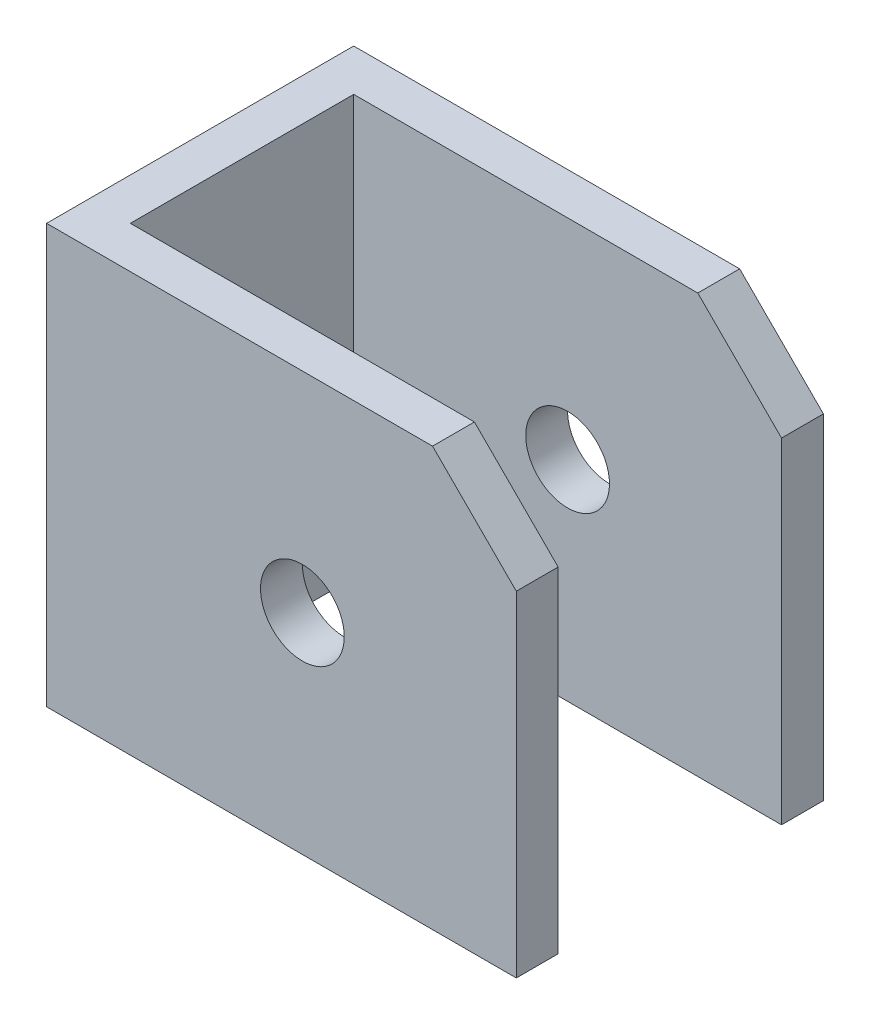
from build123d import *

# Parameters (mm, degrees)
EXTRUDE_THIN1_DEPTH        = 50
F_10_0_10_DIAMETER_HOLE1_D = 10
CHAMFER1_SIZE              = 10


with BuildPart() as part:
    # Sketch1 → Extrude-Thin1 (new body)
    with BuildSketch(Plane(origin=(0, 0, 0), x_dir=(1, 0, 0), z_dir=(0, 1, 0))):
        Polygon((28.04270703, -18.335456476), (-28.04270703, -18.335456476), (-28.04270703, 18.335456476), (28.04270703, 18.335456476), (28.04270703, 13.335456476), (-23.04270703, 13.335456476), (-23.04270703, -13.335456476), (28.04270703, -13.335456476), align=None)
    extrude(amount=EXTRUDE_THIN1_DEPTH)

    # 10.0 _10_ Diameter Hole1 (through all)
    with Locations(Plane.XY.offset(18.335456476)):
        with Locations((2.5, 25)):
            Hole(F_10_0_10_DIAMETER_HOLE1_D / 2)

    # Chamfer1
    chamfer1_edges = [part.edges().sort_by_distance(p)[0] for p in [
        (28.04270703, 50, 15.835456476),
        (28.04270703, 50, -15.835456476),
    ]]
    chamfer(chamfer1_edges, length=CHAMFER1_SIZE)


solid = part.part
